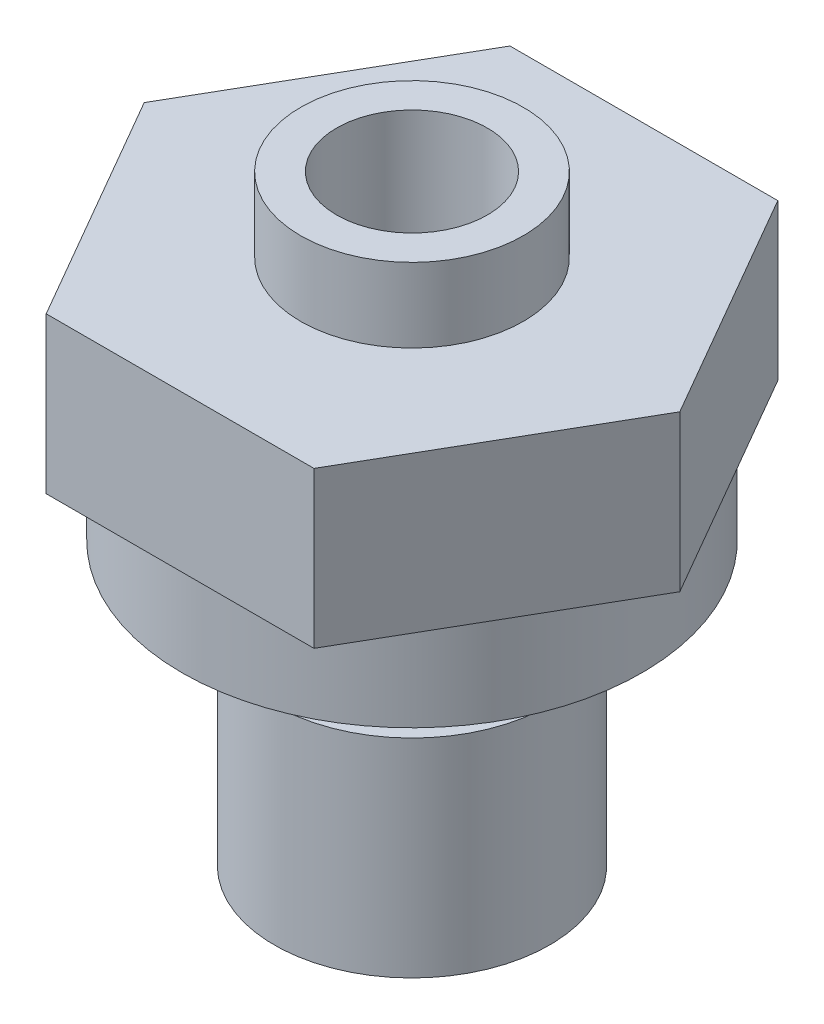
ISO-10303-21;
HEADER;
FILE_DESCRIPTION(('STEP AP214'),'2;1');
FILE_NAME('part.step','',(''),(''),'','','');
FILE_SCHEMA(('AUTOMOTIVE_DESIGN { 1 0 10303 214 1 1 1 1 }'));
ENDSEC;
DATA;
#1=APPLICATION_CONTEXT('core data for automotive mechanical design processes');
#2=APPLICATION_PROTOCOL_DEFINITION('international standard','automotive_design',2000,#1);
#3=PRODUCT_CONTEXT('',#1,'mechanical');
#4=PRODUCT('Part','Part','',(#3));
#5=PRODUCT_RELATED_PRODUCT_CATEGORY('part','',(#4));
#6=PRODUCT_DEFINITION_FORMATION('','',#4);
#7=PRODUCT_DEFINITION_CONTEXT('part definition',#1,'design');
#8=PRODUCT_DEFINITION('design','',#6,#7);
#9=PRODUCT_DEFINITION_SHAPE('','',#8);
#10=(LENGTH_UNIT() NAMED_UNIT(*) SI_UNIT(.MILLI.,.METRE.));
#11=(NAMED_UNIT(*) PLANE_ANGLE_UNIT() SI_UNIT($,.RADIAN.));
#12=(NAMED_UNIT(*) SI_UNIT($,.STERADIAN.) SOLID_ANGLE_UNIT());
#13=UNCERTAINTY_MEASURE_WITH_UNIT(LENGTH_MEASURE(1.E-05),#10,'distance_accuracy_value','');
#14=(GEOMETRIC_REPRESENTATION_CONTEXT(3) GLOBAL_UNCERTAINTY_ASSIGNED_CONTEXT((#13)) GLOBAL_UNIT_ASSIGNED_CONTEXT((#10,
#11,#12)) REPRESENTATION_CONTEXT('',''));
#15=CARTESIAN_POINT('',(0.,0.,0.));
#16=DIRECTION('',(0.,0.,1.));
#17=DIRECTION('',(1.,0.,0.));
#18=AXIS2_PLACEMENT_3D('',#15,#16,#17);
#19=CARTESIAN_POINT('',(0.,-12.7,0.));
#20=DIRECTION('',(0.,1.,0.));
#21=DIRECTION('',(0.,0.,1.));
#22=AXIS2_PLACEMENT_3D('',#19,#20,#21);
#23=CYLINDRICAL_SURFACE('',#22,1.524);
#24=CARTESIAN_POINT('',(0.,-8.63599999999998,0.));
#25=DIRECTION('',(0.,-1.,0.));
#26=DIRECTION('',(0.,0.,-1.));
#27=AXIS2_PLACEMENT_3D('',#24,#25,#26);
#28=CIRCLE('',#27,1.524);
#29=CARTESIAN_POINT('',(0.,-8.63599999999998,-1.524));
#30=VERTEX_POINT('',#29);
#31=EDGE_CURVE('E11',#30,#30,#28,.T.);
#32=ORIENTED_EDGE('',*,*,#31,.T.);
#33=EDGE_LOOP('',(#32));
#34=FACE_BOUND('',#33,.T.);
#35=CARTESIAN_POINT('',(0.,3.556,0.));
#36=DIRECTION('',(0.,1.,0.));
#37=DIRECTION('',(0.,0.,1.));
#38=AXIS2_PLACEMENT_3D('',#35,#36,#37);
#39=CIRCLE('',#38,1.524);
#40=CARTESIAN_POINT('',(0.,3.556,1.524));
#41=VERTEX_POINT('',#40);
#42=EDGE_CURVE('E119',#41,#41,#39,.T.);
#43=ORIENTED_EDGE('',*,*,#42,.T.);
#44=EDGE_LOOP('',(#43));
#45=FACE_BOUND('',#44,.T.);
#46=ADVANCED_FACE('F30',(#34,#45),#23,.F.);
#47=CARTESIAN_POINT('',(9.16543552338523,5.334,0.));
#48=DIRECTION('',(0.,1.,0.));
#49=DIRECTION('',(0.,0.,1.));
#50=AXIS2_PLACEMENT_3D('',#47,#48,#49);
#51=PLANE('',#50);
#52=DIRECTION('',(-0.499999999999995,0.,-0.866025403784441));
#53=VECTOR('',#52,1.);
#54=CARTESIAN_POINT('',(6.87407664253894,5.334,-3.96874999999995));
#55=LINE('',#54,#53);
#56=CARTESIAN_POINT('',(9.16543552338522,5.334,0.));
#57=VERTEX_POINT('',#56);
#58=CARTESIAN_POINT('',(4.5827177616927,5.334,-7.93749999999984));
#59=VERTEX_POINT('',#58);
#60=EDGE_CURVE('E103',#57,#59,#55,.T.);
#61=ORIENTED_EDGE('',*,*,#60,.T.);
#62=DIRECTION('',(-1.,0.,0.));
#63=VECTOR('',#62,1.);
#64=CARTESIAN_POINT('',(0.,5.334,-7.9375));
#65=LINE('',#64,#63);
#66=CARTESIAN_POINT('',(-4.5827177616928,5.334,-7.93749999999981));
#67=VERTEX_POINT('',#66);
#68=EDGE_CURVE('E106',#59,#67,#65,.T.);
#69=ORIENTED_EDGE('',*,*,#68,.T.);
#70=DIRECTION('',(-0.499999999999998,0.,0.86602540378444));
#71=VECTOR('',#70,1.);
#72=CARTESIAN_POINT('',(-6.87407664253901,5.334,-3.96874999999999));
#73=LINE('',#72,#71);
#74=CARTESIAN_POINT('',(-9.16543552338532,5.334,0.));
#75=VERTEX_POINT('',#74);
#76=EDGE_CURVE('E236',#67,#75,#73,.T.);
#77=ORIENTED_EDGE('',*,*,#76,.T.);
#78=DIRECTION('',(0.499999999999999,0.,0.866025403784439));
#79=VECTOR('',#78,1.);
#80=CARTESIAN_POINT('',(-6.87407664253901,5.334,3.96874999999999));
#81=LINE('',#80,#79);
#82=CARTESIAN_POINT('',(-4.58271776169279,5.334,7.9374999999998));
#83=VERTEX_POINT('',#82);
#84=EDGE_CURVE('E225',#75,#83,#81,.T.);
#85=ORIENTED_EDGE('',*,*,#84,.T.);
#86=DIRECTION('',(1.,0.,0.));
#87=VECTOR('',#86,1.);
#88=CARTESIAN_POINT('',(0.,5.334,7.9375));
#89=LINE('',#88,#87);
#90=CARTESIAN_POINT('',(4.5827177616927,5.334,7.93749999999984));
#91=VERTEX_POINT('',#90);
#92=EDGE_CURVE('E50',#83,#91,#89,.T.);
#93=ORIENTED_EDGE('',*,*,#92,.T.);
#94=DIRECTION('',(0.499999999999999,0.,-0.866025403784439));
#95=VECTOR('',#94,1.);
#96=CARTESIAN_POINT('',(6.87407664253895,5.334,3.96874999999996));
#97=LINE('',#96,#95);
#98=EDGE_CURVE('E45',#91,#57,#97,.T.);
#99=ORIENTED_EDGE('',*,*,#98,.T.);
#100=EDGE_LOOP('',(#61,#69,#77,#85,#93,#99));
#101=FACE_BOUND('',#100,.T.);
#102=CARTESIAN_POINT('',(0.,5.334,0.));
#103=DIRECTION('',(0.,1.,0.));
#104=DIRECTION('',(0.,0.,1.));
#105=AXIS2_PLACEMENT_3D('',#102,#103,#104);
#106=CIRCLE('',#105,3.81);
#107=CARTESIAN_POINT('',(0.,5.334,3.81));
#108=VERTEX_POINT('',#107);
#109=EDGE_CURVE('E274',#108,#108,#106,.T.);
#110=ORIENTED_EDGE('',*,*,#109,.F.);
#111=EDGE_LOOP('',(#110));
#112=FACE_BOUND('',#111,.T.);
#113=ADVANCED_FACE('F140',(#101,#112),#51,.T.);
#114=CARTESIAN_POINT('',(0.,-3.048,0.));
#115=DIRECTION('',(0.,-1.,0.));
#116=DIRECTION('',(0.,0.,-1.));
#117=AXIS2_PLACEMENT_3D('',#114,#115,#116);
#118=PLANE('',#117);
#119=CARTESIAN_POINT('',(0.,-3.048,0.));
#120=DIRECTION('',(0.,-1.,0.));
#121=DIRECTION('',(0.,0.,-1.));
#122=AXIS2_PLACEMENT_3D('',#119,#120,#121);
#123=CIRCLE('',#122,4.826);
#124=CARTESIAN_POINT('',(0.,-3.048,-4.826));
#125=VERTEX_POINT('',#124);
#126=EDGE_CURVE('E256',#125,#125,#123,.T.);
#127=ORIENTED_EDGE('',*,*,#126,.T.);
#128=EDGE_LOOP('',(#127));
#129=FACE_BOUND('',#128,.T.);
#130=CARTESIAN_POINT('',(0.,-3.048,0.));
#131=DIRECTION('',(0.,-1.,0.));
#132=DIRECTION('',(0.,0.,-1.));
#133=AXIS2_PLACEMENT_3D('',#130,#131,#132);
#134=CIRCLE('',#133,3.9751);
#135=CARTESIAN_POINT('',(0.,-3.048,-3.9751));
#136=VERTEX_POINT('',#135);
#137=EDGE_CURVE('E262',#136,#136,#134,.T.);
#138=ORIENTED_EDGE('',*,*,#137,.F.);
#139=EDGE_LOOP('',(#138));
#140=FACE_BOUND('',#139,.T.);
#141=ADVANCED_FACE('F146',(#129,#140),#118,.T.);
#142=CARTESIAN_POINT('',(9.16543552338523,0.,0.));
#143=DIRECTION('',(0.,1.,0.));
#144=DIRECTION('',(0.,0.,1.));
#145=AXIS2_PLACEMENT_3D('',#142,#143,#144);
#146=PLANE('',#145);
#147=DIRECTION('',(-1.,0.,0.));
#148=VECTOR('',#147,1.);
#149=CARTESIAN_POINT('',(0.,0.,-7.9375));
#150=LINE('',#149,#148);
#151=CARTESIAN_POINT('',(4.5827177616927,0.,-7.93749999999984));
#152=VERTEX_POINT('',#151);
#153=CARTESIAN_POINT('',(-4.5827177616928,0.,-7.93749999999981));
#154=VERTEX_POINT('',#153);
#155=EDGE_CURVE('E83',#152,#154,#150,.T.);
#156=ORIENTED_EDGE('',*,*,#155,.F.);
#157=DIRECTION('',(-0.499999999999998,0.,-0.86602540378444));
#158=VECTOR('',#157,1.);
#159=CARTESIAN_POINT('',(6.87407664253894,0.,-3.96874999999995));
#160=LINE('',#159,#158);
#161=CARTESIAN_POINT('',(9.16543552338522,0.,0.));
#162=VERTEX_POINT('',#161);
#163=EDGE_CURVE('E87',#162,#152,#160,.T.);
#164=ORIENTED_EDGE('',*,*,#163,.F.);
#165=DIRECTION('',(0.499999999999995,0.,-0.866025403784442));
#166=VECTOR('',#165,1.);
#167=CARTESIAN_POINT('',(6.87407664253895,0.,3.96874999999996));
#168=LINE('',#167,#166);
#169=CARTESIAN_POINT('',(4.5827177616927,0.,7.93749999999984));
#170=VERTEX_POINT('',#169);
#171=EDGE_CURVE('E104',#170,#162,#168,.T.);
#172=ORIENTED_EDGE('',*,*,#171,.F.);
#173=DIRECTION('',(1.,0.,0.));
#174=VECTOR('',#173,1.);
#175=CARTESIAN_POINT('',(0.,0.,7.9375));
#176=LINE('',#175,#174);
#177=CARTESIAN_POINT('',(-4.58271776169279,0.,7.9374999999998));
#178=VERTEX_POINT('',#177);
#179=EDGE_CURVE('E241',#178,#170,#176,.T.);
#180=ORIENTED_EDGE('',*,*,#179,.F.);
#181=DIRECTION('',(0.500000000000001,0.,0.866025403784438));
#182=VECTOR('',#181,1.);
#183=CARTESIAN_POINT('',(-6.87407664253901,0.,3.96874999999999));
#184=LINE('',#183,#182);
#185=CARTESIAN_POINT('',(-9.16543552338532,0.,0.));
#186=VERTEX_POINT('',#185);
#187=EDGE_CURVE('E220',#186,#178,#184,.T.);
#188=ORIENTED_EDGE('',*,*,#187,.F.);
#189=DIRECTION('',(-0.499999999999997,0.,0.86602540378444));
#190=VECTOR('',#189,1.);
#191=CARTESIAN_POINT('',(-6.87407664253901,0.,-3.96874999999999));
#192=LINE('',#191,#190);
#193=EDGE_CURVE('E89',#154,#186,#192,.T.);
#194=ORIENTED_EDGE('',*,*,#193,.F.);
#195=EDGE_LOOP('',(#156,#164,#172,#180,#188,#194));
#196=FACE_BOUND('',#195,.T.);
#197=CARTESIAN_POINT('',(0.,0.,0.));
#198=DIRECTION('',(0.,1.,0.));
#199=DIRECTION('',(0.,0.,1.));
#200=AXIS2_PLACEMENT_3D('',#197,#198,#199);
#201=CIRCLE('',#200,7.874);
#202=CARTESIAN_POINT('',(0.,0.,7.874));
#203=VERTEX_POINT('',#202);
#204=EDGE_CURVE('E107',#203,#203,#201,.F.);
#205=ORIENTED_EDGE('',*,*,#204,.F.);
#206=EDGE_LOOP('',(#205));
#207=FACE_BOUND('',#206,.T.);
#208=ADVANCED_FACE('F85',(#196,#207),#146,.F.);
#209=CARTESIAN_POINT('',(0.,5.334,-7.9375));
#210=DIRECTION('',(0.,0.,1.));
#211=DIRECTION('',(1.,0.,0.));
#212=AXIS2_PLACEMENT_3D('',#209,#210,#211);
#213=PLANE('',#212);
#214=ORIENTED_EDGE('',*,*,#155,.T.);
#215=DIRECTION('',(0.,-1.,0.));
#216=VECTOR('',#215,1.);
#217=CARTESIAN_POINT('',(-4.5827177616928,5.334,-7.93749999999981));
#218=LINE('',#217,#216);
#219=EDGE_CURVE('E108',#67,#154,#218,.T.);
#220=ORIENTED_EDGE('',*,*,#219,.F.);
#221=ORIENTED_EDGE('',*,*,#68,.F.);
#222=DIRECTION('',(0.,-1.,0.));
#223=VECTOR('',#222,1.);
#224=CARTESIAN_POINT('',(4.5827177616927,5.334,-7.93749999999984));
#225=LINE('',#224,#223);
#226=EDGE_CURVE('E100',#59,#152,#225,.T.);
#227=ORIENTED_EDGE('',*,*,#226,.T.);
#228=EDGE_LOOP('',(#214,#220,#221,#227));
#229=FACE_BOUND('',#228,.T.);
#230=ADVANCED_FACE('F32',(#229),#213,.F.);
#231=CARTESIAN_POINT('',(-6.87407664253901,5.334,-3.96874999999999));
#232=DIRECTION('',(0.866025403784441,0.,0.499999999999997));
#233=DIRECTION('',(0.499999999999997,0.,-0.866025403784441));
#234=AXIS2_PLACEMENT_3D('',#231,#232,#233);
#235=PLANE('',#234);
#236=ORIENTED_EDGE('',*,*,#193,.T.);
#237=DIRECTION('',(0.,-1.,0.));
#238=VECTOR('',#237,1.);
#239=CARTESIAN_POINT('',(-9.16543552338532,5.334,0.));
#240=LINE('',#239,#238);
#241=EDGE_CURVE('E113',#75,#186,#240,.T.);
#242=ORIENTED_EDGE('',*,*,#241,.F.);
#243=ORIENTED_EDGE('',*,*,#76,.F.);
#244=ORIENTED_EDGE('',*,*,#219,.T.);
#245=EDGE_LOOP('',(#236,#242,#243,#244));
#246=FACE_BOUND('',#245,.T.);
#247=ADVANCED_FACE('F209',(#246),#235,.F.);
#248=CARTESIAN_POINT('',(-6.87407664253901,5.334,3.96874999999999));
#249=DIRECTION('',(0.866025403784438,0.,-0.500000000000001));
#250=DIRECTION('',(-0.500000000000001,0.,-0.866025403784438));
#251=AXIS2_PLACEMENT_3D('',#248,#249,#250);
#252=PLANE('',#251);
#253=ORIENTED_EDGE('',*,*,#187,.T.);
#254=DIRECTION('',(0.,-1.,0.));
#255=VECTOR('',#254,1.);
#256=CARTESIAN_POINT('',(-4.58271776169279,5.334,7.9374999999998));
#257=LINE('',#256,#255);
#258=EDGE_CURVE('E226',#83,#178,#257,.T.);
#259=ORIENTED_EDGE('',*,*,#258,.F.);
#260=ORIENTED_EDGE('',*,*,#84,.F.);
#261=ORIENTED_EDGE('',*,*,#241,.T.);
#262=EDGE_LOOP('',(#253,#259,#260,#261));
#263=FACE_BOUND('',#262,.T.);
#264=ADVANCED_FACE('F206',(#263),#252,.F.);
#265=CARTESIAN_POINT('',(0.,5.334,7.9375));
#266=DIRECTION('',(0.,0.,-1.));
#267=DIRECTION('',(-1.,0.,0.));
#268=AXIS2_PLACEMENT_3D('',#265,#266,#267);
#269=PLANE('',#268);
#270=ORIENTED_EDGE('',*,*,#179,.T.);
#271=DIRECTION('',(0.,-1.,0.));
#272=VECTOR('',#271,1.);
#273=CARTESIAN_POINT('',(4.5827177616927,5.334,7.93749999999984));
#274=LINE('',#273,#272);
#275=EDGE_CURVE('E227',#91,#170,#274,.T.);
#276=ORIENTED_EDGE('',*,*,#275,.F.);
#277=ORIENTED_EDGE('',*,*,#92,.F.);
#278=ORIENTED_EDGE('',*,*,#258,.T.);
#279=EDGE_LOOP('',(#270,#276,#277,#278));
#280=FACE_BOUND('',#279,.T.);
#281=ADVANCED_FACE('F202',(#280),#269,.F.);
#282=CARTESIAN_POINT('',(6.87407664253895,5.334,3.96874999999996));
#283=DIRECTION('',(-0.866025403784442,0.,-0.499999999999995));
#284=DIRECTION('',(-0.499999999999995,0.,0.866025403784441));
#285=AXIS2_PLACEMENT_3D('',#282,#283,#284);
#286=PLANE('',#285);
#287=ORIENTED_EDGE('',*,*,#171,.T.);
#288=DIRECTION('',(0.,-1.,0.));
#289=VECTOR('',#288,1.);
#290=CARTESIAN_POINT('',(9.16543552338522,5.334,0.));
#291=LINE('',#290,#289);
#292=EDGE_CURVE('E102',#57,#162,#291,.T.);
#293=ORIENTED_EDGE('',*,*,#292,.F.);
#294=ORIENTED_EDGE('',*,*,#98,.F.);
#295=ORIENTED_EDGE('',*,*,#275,.T.);
#296=EDGE_LOOP('',(#287,#293,#294,#295));
#297=FACE_BOUND('',#296,.T.);
#298=ADVANCED_FACE('F199',(#297),#286,.F.);
#299=CARTESIAN_POINT('',(6.87407664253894,5.334,-3.96874999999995));
#300=DIRECTION('',(-0.86602540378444,0.,0.499999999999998));
#301=DIRECTION('',(0.499999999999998,0.,0.86602540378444));
#302=AXIS2_PLACEMENT_3D('',#299,#300,#301);
#303=PLANE('',#302);
#304=ORIENTED_EDGE('',*,*,#163,.T.);
#305=ORIENTED_EDGE('',*,*,#226,.F.);
#306=ORIENTED_EDGE('',*,*,#60,.F.);
#307=ORIENTED_EDGE('',*,*,#292,.T.);
#308=EDGE_LOOP('',(#304,#305,#306,#307));
#309=FACE_BOUND('',#308,.T.);
#310=ADVANCED_FACE('F99',(#309),#303,.F.);
#311=CARTESIAN_POINT('',(0.,-3.048,0.));
#312=DIRECTION('',(0.,1.,0.));
#313=DIRECTION('',(0.,0.,1.));
#314=AXIS2_PLACEMENT_3D('',#311,#312,#313);
#315=CYLINDRICAL_SURFACE('',#314,7.874);
#316=CARTESIAN_POINT('',(0.,-3.048,0.));
#317=DIRECTION('',(0.,-1.,0.));
#318=DIRECTION('',(0.,0.,-1.));
#319=AXIS2_PLACEMENT_3D('',#316,#317,#318);
#320=CIRCLE('',#319,7.874);
#321=CARTESIAN_POINT('',(0.,-3.048,7.874));
#322=VERTEX_POINT('',#321);
#323=EDGE_CURVE('E94',#322,#322,#320,.T.);
#324=CARTESIAN_POINT('',(0.,-3.048,7.874));
#325=CARTESIAN_POINT('',(0.,-3.01625,7.874));
#326=CARTESIAN_POINT('',(0.,-2.9845,7.874));
#327=CARTESIAN_POINT('',(0.,-2.921,7.874));
#328=CARTESIAN_POINT('',(0.,-2.88925,7.874));
#329=CARTESIAN_POINT('',(0.,-2.82575,7.874));
#330=CARTESIAN_POINT('',(0.,-2.794,7.874));
#331=CARTESIAN_POINT('',(0.,-2.7305,7.874));
#332=CARTESIAN_POINT('',(0.,-2.69875,7.874));
#333=CARTESIAN_POINT('',(0.,-2.63525,7.874));
#334=CARTESIAN_POINT('',(0.,-2.6035,7.874));
#335=CARTESIAN_POINT('',(0.,-2.54,7.874));
#336=CARTESIAN_POINT('',(0.,-2.50825,7.874));
#337=CARTESIAN_POINT('',(0.,-2.44475,7.874));
#338=CARTESIAN_POINT('',(0.,-2.413,7.874));
#339=CARTESIAN_POINT('',(0.,-2.3495,7.874));
#340=CARTESIAN_POINT('',(0.,-2.31775,7.874));
#341=CARTESIAN_POINT('',(0.,-2.25425,7.874));
#342=CARTESIAN_POINT('',(0.,-2.2225,7.874));
#343=CARTESIAN_POINT('',(0.,-2.159,7.874));
#344=CARTESIAN_POINT('',(0.,-2.12725,7.874));
#345=CARTESIAN_POINT('',(0.,-2.06375,7.874));
#346=CARTESIAN_POINT('',(0.,-2.032,7.874));
#347=CARTESIAN_POINT('',(0.,-1.9685,7.874));
#348=CARTESIAN_POINT('',(0.,-1.93675,7.874));
#349=CARTESIAN_POINT('',(0.,-1.87325,7.874));
#350=CARTESIAN_POINT('',(0.,-1.8415,7.874));
#351=CARTESIAN_POINT('',(0.,-1.778,7.874));
#352=CARTESIAN_POINT('',(0.,-1.74625,7.874));
#353=CARTESIAN_POINT('',(0.,-1.68275,7.874));
#354=CARTESIAN_POINT('',(0.,-1.651,7.874));
#355=CARTESIAN_POINT('',(0.,-1.5875,7.874));
#356=CARTESIAN_POINT('',(0.,-1.55575,7.874));
#357=CARTESIAN_POINT('',(0.,-1.49225,7.874));
#358=CARTESIAN_POINT('',(0.,-1.4605,7.874));
#359=CARTESIAN_POINT('',(0.,-1.397,7.874));
#360=CARTESIAN_POINT('',(0.,-1.36525,7.874));
#361=CARTESIAN_POINT('',(0.,-1.30175,7.874));
#362=CARTESIAN_POINT('',(0.,-1.27,7.874));
#363=CARTESIAN_POINT('',(0.,-1.2065,7.874));
#364=CARTESIAN_POINT('',(0.,-1.17475,7.874));
#365=CARTESIAN_POINT('',(0.,-1.11125,7.874));
#366=CARTESIAN_POINT('',(0.,-1.0795,7.874));
#367=CARTESIAN_POINT('',(0.,-1.016,7.874));
#368=CARTESIAN_POINT('',(0.,-0.98425,7.874));
#369=CARTESIAN_POINT('',(0.,-0.92075,7.874));
#370=CARTESIAN_POINT('',(0.,-0.889,7.874));
#371=CARTESIAN_POINT('',(0.,-0.8255,7.874));
#372=CARTESIAN_POINT('',(0.,-0.79375,7.874));
#373=CARTESIAN_POINT('',(0.,-0.73025,7.874));
#374=CARTESIAN_POINT('',(0.,-0.6985,7.874));
#375=CARTESIAN_POINT('',(0.,-0.635,7.874));
#376=CARTESIAN_POINT('',(0.,-0.60325,7.874));
#377=CARTESIAN_POINT('',(0.,-0.53975,7.874));
#378=CARTESIAN_POINT('',(0.,-0.508,7.874));
#379=CARTESIAN_POINT('',(0.,-0.4445,7.874));
#380=CARTESIAN_POINT('',(0.,-0.41275,7.874));
#381=CARTESIAN_POINT('',(0.,-0.34925,7.874));
#382=CARTESIAN_POINT('',(0.,-0.3175,7.874));
#383=CARTESIAN_POINT('',(0.,-0.254,7.874));
#384=CARTESIAN_POINT('',(0.,-0.22225,7.874));
#385=CARTESIAN_POINT('',(0.,-0.15875,7.874));
#386=CARTESIAN_POINT('',(0.,-0.127,7.874));
#387=CARTESIAN_POINT('',(0.,-0.0634999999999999,7.874));
#388=CARTESIAN_POINT('',(0.,-0.03175,7.874));
#389=CARTESIAN_POINT('',(0.,0.,7.874));
#390=B_SPLINE_CURVE_WITH_KNOTS('',3,(#324,#325,#326,#327,#328,#329,#330,#331,#332,#333,#334,
#335,#336,#337,#338,#339,#340,#341,#342,#343,#344,#345,#346,#347,#348,#349,#350,#351,#352,#353,
#354,#355,#356,#357,#358,#359,#360,#361,#362,#363,#364,#365,#366,#367,#368,#369,#370,#371,#372,
#373,#374,#375,#376,#377,#378,#379,#380,#381,#382,#383,#384,#385,#386,#387,#388,#389),
.UNSPECIFIED.,.F.,.F.,(4,2,2,2,2,2,2,2,2,2,2,2,2,2,2,2,2,2,2,2,2,2,2,2,2,2,2,2,2,2,2,2,4),(0.,
0.0952499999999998,0.1905,0.28575,0.381,0.47625,0.5715,0.66675,0.762,0.85725,0.9525,1.04775,
1.143,1.23825,1.3335,1.42875,1.524,1.61925,1.7145,1.80975,1.905,2.00025,2.0955,2.19075,2.286,
2.38125,2.4765,2.57175,2.667,2.76225,2.8575,2.95275,3.048),.UNSPECIFIED.);
#391=EDGE_CURVE('BSEAM190',#322,#203,#390,.T.);
#392=ORIENTED_EDGE('',*,*,#323,.F.);
#393=ORIENTED_EDGE('',*,*,#204,.T.);
#394=ORIENTED_EDGE('',*,*,#391,.T.);
#395=ORIENTED_EDGE('',*,*,#391,.F.);
#396=EDGE_LOOP('',(#392,#394,#393,#395));
#397=FACE_BOUND('',#396,.T.);
#398=ADVANCED_FACE('F190',(#397),#315,.T.);
#399=CARTESIAN_POINT('',(0.,-3.048,0.));
#400=DIRECTION('',(0.,-1.,0.));
#401=DIRECTION('',(0.,0.,-1.));
#402=AXIS2_PLACEMENT_3D('',#399,#400,#401);
#403=CIRCLE('',#402,6.985);
#404=CARTESIAN_POINT('',(0.,-3.048,-6.985));
#405=VERTEX_POINT('',#404);
#406=EDGE_CURVE('E250',#405,#405,#403,.T.);
#407=ORIENTED_EDGE('',*,*,#406,.F.);
#408=EDGE_LOOP('',(#407));
#409=FACE_BOUND('',#408,.T.);
#410=ORIENTED_EDGE('',*,*,#323,.T.);
#411=EDGE_LOOP('',(#410));
#412=FACE_BOUND('',#411,.T.);
#413=ADVANCED_FACE('F186',(#409,#412),#118,.T.);
#414=CARTESIAN_POINT('',(0.,-1.778,0.));
#415=DIRECTION('',(0.,-1.,0.));
#416=DIRECTION('',(0.,0.,-1.));
#417=AXIS2_PLACEMENT_3D('',#414,#415,#416);
#418=CYLINDRICAL_SURFACE('',#417,6.985);
#419=CARTESIAN_POINT('',(0.,-1.778,0.));
#420=DIRECTION('',(0.,-1.,0.));
#421=DIRECTION('',(0.,0.,-1.));
#422=AXIS2_PLACEMENT_3D('',#419,#420,#421);
#423=CIRCLE('',#422,6.985);
#424=CARTESIAN_POINT('',(0.,-1.778,-6.985));
#425=VERTEX_POINT('',#424);
#426=EDGE_CURVE('E247',#425,#425,#423,.T.);
#427=ORIENTED_EDGE('',*,*,#426,.F.);
#428=EDGE_LOOP('',(#427));
#429=FACE_BOUND('',#428,.T.);
#430=ORIENTED_EDGE('',*,*,#406,.T.);
#431=EDGE_LOOP('',(#430));
#432=FACE_BOUND('',#431,.T.);
#433=ADVANCED_FACE('F182',(#429,#432),#418,.F.);
#434=CARTESIAN_POINT('',(0.,-1.778,0.));
#435=DIRECTION('',(0.,-1.,0.));
#436=DIRECTION('',(0.,0.,-1.));
#437=AXIS2_PLACEMENT_3D('',#434,#435,#436);
#438=PLANE('',#437);
#439=CARTESIAN_POINT('',(0.,-1.778,0.));
#440=DIRECTION('',(0.,-1.,0.));
#441=DIRECTION('',(0.,0.,-1.));
#442=AXIS2_PLACEMENT_3D('',#439,#440,#441);
#443=CIRCLE('',#442,4.826);
#444=CARTESIAN_POINT('',(0.,-1.778,-4.826));
#445=VERTEX_POINT('',#444);
#446=EDGE_CURVE('E253',#445,#445,#443,.T.);
#447=ORIENTED_EDGE('',*,*,#446,.F.);
#448=EDGE_LOOP('',(#447));
#449=FACE_BOUND('',#448,.T.);
#450=ORIENTED_EDGE('',*,*,#426,.T.);
#451=EDGE_LOOP('',(#450));
#452=FACE_BOUND('',#451,.T.);
#453=ADVANCED_FACE('F178',(#449,#452),#438,.T.);
#454=CARTESIAN_POINT('',(0.,-1.778,0.));
#455=DIRECTION('',(0.,-1.,0.));
#456=DIRECTION('',(0.,0.,-1.));
#457=AXIS2_PLACEMENT_3D('',#454,#455,#456);
#458=CYLINDRICAL_SURFACE('',#457,4.826);
#459=ORIENTED_EDGE('',*,*,#446,.T.);
#460=EDGE_LOOP('',(#459));
#461=FACE_BOUND('',#460,.T.);
#462=ORIENTED_EDGE('',*,*,#126,.F.);
#463=EDGE_LOOP('',(#462));
#464=FACE_BOUND('',#463,.T.);
#465=ADVANCED_FACE('F174',(#461,#464),#458,.T.);
#466=CARTESIAN_POINT('',(0.,-5.588,0.));
#467=DIRECTION('',(0.,1.,0.));
#468=DIRECTION('',(0.,0.,1.));
#469=AXIS2_PLACEMENT_3D('',#466,#467,#468);
#470=CYLINDRICAL_SURFACE('',#469,3.9751);
#471=CARTESIAN_POINT('',(0.,-5.588,0.));
#472=DIRECTION('',(0.,-1.,0.));
#473=DIRECTION('',(0.,0.,-1.));
#474=AXIS2_PLACEMENT_3D('',#471,#472,#473);
#475=CIRCLE('',#474,3.9751);
#476=CARTESIAN_POINT('',(0.,-5.588,-3.9751));
#477=VERTEX_POINT('',#476);
#478=EDGE_CURVE('E259',#477,#477,#475,.T.);
#479=ORIENTED_EDGE('',*,*,#478,.F.);
#480=EDGE_LOOP('',(#479));
#481=FACE_BOUND('',#480,.T.);
#482=ORIENTED_EDGE('',*,*,#137,.T.);
#483=EDGE_LOOP('',(#482));
#484=FACE_BOUND('',#483,.T.);
#485=ADVANCED_FACE('F165',(#481,#484),#470,.T.);
#486=CARTESIAN_POINT('',(0.,-5.588,0.));
#487=DIRECTION('',(0.,-1.,0.));
#488=DIRECTION('',(0.,0.,-1.));
#489=AXIS2_PLACEMENT_3D('',#486,#487,#488);
#490=PLANE('',#489);
#491=CARTESIAN_POINT('',(0.,-5.588,0.));
#492=DIRECTION('',(0.,-1.,0.));
#493=DIRECTION('',(0.,0.,-1.));
#494=AXIS2_PLACEMENT_3D('',#491,#492,#493);
#495=CIRCLE('',#494,4.7117);
#496=CARTESIAN_POINT('',(0.,-5.588,-4.7117));
#497=VERTEX_POINT('',#496);
#498=EDGE_CURVE('E268',#497,#497,#495,.T.);
#499=ORIENTED_EDGE('',*,*,#498,.F.);
#500=EDGE_LOOP('',(#499));
#501=FACE_BOUND('',#500,.T.);
#502=ORIENTED_EDGE('',*,*,#478,.T.);
#503=EDGE_LOOP('',(#502));
#504=FACE_BOUND('',#503,.T.);
#505=ADVANCED_FACE('F161',(#501,#504),#490,.F.);
#506=CARTESIAN_POINT('',(0.,-12.7,0.));
#507=DIRECTION('',(0.,1.,0.));
#508=DIRECTION('',(0.,0.,1.));
#509=AXIS2_PLACEMENT_3D('',#506,#507,#508);
#510=CYLINDRICAL_SURFACE('',#509,4.7117);
#511=CARTESIAN_POINT('',(0.,-12.7,0.));
#512=DIRECTION('',(0.,-1.,0.));
#513=DIRECTION('',(0.,0.,-1.));
#514=AXIS2_PLACEMENT_3D('',#511,#512,#513);
#515=CIRCLE('',#514,4.7117);
#516=CARTESIAN_POINT('',(0.,-12.7,-4.7117));
#517=VERTEX_POINT('',#516);
#518=EDGE_CURVE('E265',#517,#517,#515,.T.);
#519=ORIENTED_EDGE('',*,*,#518,.F.);
#520=EDGE_LOOP('',(#519));
#521=FACE_BOUND('',#520,.T.);
#522=ORIENTED_EDGE('',*,*,#498,.T.);
#523=EDGE_LOOP('',(#522));
#524=FACE_BOUND('',#523,.T.);
#525=ADVANCED_FACE('F164',(#521,#524),#510,.T.);
#526=CARTESIAN_POINT('',(0.,-12.7,0.));
#527=DIRECTION('',(0.,-1.,0.));
#528=DIRECTION('',(0.,0.,-1.));
#529=AXIS2_PLACEMENT_3D('',#526,#527,#528);
#530=PLANE('',#529);
#531=CARTESIAN_POINT('',(0.,-12.7,0.));
#532=DIRECTION('',(0.,-1.,0.));
#533=DIRECTION('',(0.,0.,-1.));
#534=AXIS2_PLACEMENT_3D('',#531,#532,#533);
#535=CIRCLE('',#534,3.87035149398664);
#536=CARTESIAN_POINT('',(0.,-12.7,-3.87035149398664));
#537=VERTEX_POINT('',#536);
#538=EDGE_CURVE('E38',#537,#537,#535,.F.);
#539=ORIENTED_EDGE('',*,*,#538,.T.);
#540=EDGE_LOOP('',(#539));
#541=FACE_BOUND('',#540,.T.);
#542=ORIENTED_EDGE('',*,*,#518,.T.);
#543=EDGE_LOOP('',(#542));
#544=FACE_BOUND('',#543,.T.);
#545=ADVANCED_FACE('F124',(#541,#544),#530,.T.);
#546=CARTESIAN_POINT('',(0.,7.874,0.));
#547=DIRECTION('',(0.,-1.,0.));
#548=DIRECTION('',(0.,0.,-1.));
#549=AXIS2_PLACEMENT_3D('',#546,#547,#548);
#550=CYLINDRICAL_SURFACE('',#549,3.81);
#551=CARTESIAN_POINT('',(0.,7.874,0.));
#552=DIRECTION('',(0.,1.,0.));
#553=DIRECTION('',(0.,0.,1.));
#554=AXIS2_PLACEMENT_3D('',#551,#552,#553);
#555=CIRCLE('',#554,3.81);
#556=CARTESIAN_POINT('',(0.,7.874,3.81));
#557=VERTEX_POINT('',#556);
#558=EDGE_CURVE('E271',#557,#557,#555,.T.);
#559=ORIENTED_EDGE('',*,*,#558,.F.);
#560=EDGE_LOOP('',(#559));
#561=FACE_BOUND('',#560,.T.);
#562=ORIENTED_EDGE('',*,*,#109,.T.);
#563=EDGE_LOOP('',(#562));
#564=FACE_BOUND('',#563,.T.);
#565=ADVANCED_FACE('F156',(#561,#564),#550,.T.);
#566=CARTESIAN_POINT('',(0.,7.874,0.));
#567=DIRECTION('',(0.,1.,0.));
#568=DIRECTION('',(0.,0.,1.));
#569=AXIS2_PLACEMENT_3D('',#566,#567,#568);
#570=PLANE('',#569);
#571=CARTESIAN_POINT('',(0.,7.874,0.));
#572=DIRECTION('',(0.,1.,0.));
#573=DIRECTION('',(0.,0.,1.));
#574=AXIS2_PLACEMENT_3D('',#571,#572,#573);
#575=CIRCLE('',#574,2.58064);
#576=CARTESIAN_POINT('',(0.,7.874,2.58064));
#577=VERTEX_POINT('',#576);
#578=EDGE_CURVE('E280',#577,#577,#575,.T.);
#579=ORIENTED_EDGE('',*,*,#578,.F.);
#580=EDGE_LOOP('',(#579));
#581=FACE_BOUND('',#580,.T.);
#582=ORIENTED_EDGE('',*,*,#558,.T.);
#583=EDGE_LOOP('',(#582));
#584=FACE_BOUND('',#583,.T.);
#585=ADVANCED_FACE('F152',(#581,#584),#570,.T.);
#586=CARTESIAN_POINT('',(0.,4.064,0.));
#587=DIRECTION('',(0.,1.,0.));
#588=DIRECTION('',(0.,0.,1.));
#589=AXIS2_PLACEMENT_3D('',#586,#587,#588);
#590=PLANE('',#589);
#591=CARTESIAN_POINT('',(0.,4.064,0.));
#592=DIRECTION('',(0.,1.,0.));
#593=DIRECTION('',(0.,0.,1.));
#594=AXIS2_PLACEMENT_3D('',#591,#592,#593);
#595=CIRCLE('',#594,2.54);
#596=CARTESIAN_POINT('',(0.,4.064,2.54));
#597=VERTEX_POINT('',#596);
#598=EDGE_CURVE('E111',#597,#597,#595,.F.);
#599=ORIENTED_EDGE('',*,*,#598,.T.);
#600=EDGE_LOOP('',(#599));
#601=FACE_BOUND('',#600,.T.);
#602=CARTESIAN_POINT('',(0.,4.064,0.));
#603=DIRECTION('',(0.,1.,0.));
#604=DIRECTION('',(0.,0.,1.));
#605=AXIS2_PLACEMENT_3D('',#602,#603,#604);
#606=CIRCLE('',#605,2.58064);
#607=CARTESIAN_POINT('',(0.,4.064,2.58064));
#608=VERTEX_POINT('',#607);
#609=EDGE_CURVE('E277',#608,#608,#606,.T.);
#610=ORIENTED_EDGE('',*,*,#609,.T.);
#611=EDGE_LOOP('',(#610));
#612=FACE_BOUND('',#611,.T.);
#613=ADVANCED_FACE('F155',(#601,#612),#590,.T.);
#614=CARTESIAN_POINT('',(0.,4.064,0.));
#615=DIRECTION('',(0.,1.,0.));
#616=DIRECTION('',(0.,0.,1.));
#617=AXIS2_PLACEMENT_3D('',#614,#615,#616);
#618=CYLINDRICAL_SURFACE('',#617,2.58064);
#619=CARTESIAN_POINT('',(0.,4.064,2.58064));
#620=CARTESIAN_POINT('',(0.,4.1036875,2.58064));
#621=CARTESIAN_POINT('',(0.,4.143375,2.58064));
#622=CARTESIAN_POINT('',(0.,4.22275,2.58064));
#623=CARTESIAN_POINT('',(0.,4.2624375,2.58064));
#624=CARTESIAN_POINT('',(0.,4.3418125,2.58064));
#625=CARTESIAN_POINT('',(0.,4.3815,2.58064));
#626=CARTESIAN_POINT('',(0.,4.460875,2.58064));
#627=CARTESIAN_POINT('',(0.,4.5005625,2.58064));
#628=CARTESIAN_POINT('',(0.,4.5799375,2.58064));
#629=CARTESIAN_POINT('',(0.,4.619625,2.58064));
#630=CARTESIAN_POINT('',(0.,4.699,2.58064));
#631=CARTESIAN_POINT('',(0.,4.7386875,2.58064));
#632=CARTESIAN_POINT('',(0.,4.8180625,2.58064));
#633=CARTESIAN_POINT('',(0.,4.85775,2.58064));
#634=CARTESIAN_POINT('',(0.,4.937125,2.58064));
#635=CARTESIAN_POINT('',(0.,4.9768125,2.58064));
#636=CARTESIAN_POINT('',(0.,5.0561875,2.58064));
#637=CARTESIAN_POINT('',(0.,5.095875,2.58064));
#638=CARTESIAN_POINT('',(0.,5.17525,2.58064));
#639=CARTESIAN_POINT('',(0.,5.2149375,2.58064));
#640=CARTESIAN_POINT('',(0.,5.2943125,2.58064));
#641=CARTESIAN_POINT('',(0.,5.334,2.58064));
#642=CARTESIAN_POINT('',(0.,5.413375,2.58064));
#643=CARTESIAN_POINT('',(0.,5.4530625,2.58064));
#644=CARTESIAN_POINT('',(0.,5.5324375,2.58064));
#645=CARTESIAN_POINT('',(0.,5.572125,2.58064));
#646=CARTESIAN_POINT('',(0.,5.6515,2.58064));
#647=CARTESIAN_POINT('',(0.,5.6911875,2.58064));
#648=CARTESIAN_POINT('',(0.,5.7705625,2.58064));
#649=CARTESIAN_POINT('',(0.,5.81025,2.58064));
#650=CARTESIAN_POINT('',(0.,5.889625,2.58064));
#651=CARTESIAN_POINT('',(0.,5.9293125,2.58064));
#652=CARTESIAN_POINT('',(0.,6.0086875,2.58064));
#653=CARTESIAN_POINT('',(0.,6.048375,2.58064));
#654=CARTESIAN_POINT('',(0.,6.12775,2.58064));
#655=CARTESIAN_POINT('',(0.,6.1674375,2.58064));
#656=CARTESIAN_POINT('',(0.,6.2468125,2.58064));
#657=CARTESIAN_POINT('',(0.,6.2865,2.58064));
#658=CARTESIAN_POINT('',(0.,6.365875,2.58064));
#659=CARTESIAN_POINT('',(0.,6.4055625,2.58064));
#660=CARTESIAN_POINT('',(0.,6.4849375,2.58064));
#661=CARTESIAN_POINT('',(0.,6.524625,2.58064));
#662=CARTESIAN_POINT('',(0.,6.604,2.58064));
#663=CARTESIAN_POINT('',(0.,6.6436875,2.58064));
#664=CARTESIAN_POINT('',(0.,6.7230625,2.58064));
#665=CARTESIAN_POINT('',(0.,6.76275,2.58064));
#666=CARTESIAN_POINT('',(0.,6.842125,2.58064));
#667=CARTESIAN_POINT('',(0.,6.8818125,2.58064));
#668=CARTESIAN_POINT('',(0.,6.9611875,2.58064));
#669=CARTESIAN_POINT('',(0.,7.000875,2.58064));
#670=CARTESIAN_POINT('',(0.,7.08025,2.58064));
#671=CARTESIAN_POINT('',(0.,7.1199375,2.58064));
#672=CARTESIAN_POINT('',(0.,7.1993125,2.58064));
#673=CARTESIAN_POINT('',(0.,7.239,2.58064));
#674=CARTESIAN_POINT('',(0.,7.318375,2.58064));
#675=CARTESIAN_POINT('',(0.,7.3580625,2.58064));
#676=CARTESIAN_POINT('',(0.,7.4374375,2.58064));
#677=CARTESIAN_POINT('',(0.,7.477125,2.58064));
#678=CARTESIAN_POINT('',(0.,7.5565,2.58064));
#679=CARTESIAN_POINT('',(0.,7.5961875,2.58064));
#680=CARTESIAN_POINT('',(0.,7.6755625,2.58064));
#681=CARTESIAN_POINT('',(0.,7.71525,2.58064));
#682=CARTESIAN_POINT('',(0.,7.794625,2.58064));
#683=CARTESIAN_POINT('',(0.,7.8343125,2.58064));
#684=CARTESIAN_POINT('',(0.,7.874,2.58064));
#685=B_SPLINE_CURVE_WITH_KNOTS('',3,(#619,#620,#621,#622,#623,#624,#625,#626,#627,#628,#629,
#630,#631,#632,#633,#634,#635,#636,#637,#638,#639,#640,#641,#642,#643,#644,#645,#646,#647,#648,
#649,#650,#651,#652,#653,#654,#655,#656,#657,#658,#659,#660,#661,#662,#663,#664,#665,#666,#667,
#668,#669,#670,#671,#672,#673,#674,#675,#676,#677,#678,#679,#680,#681,#682,#683,#684),
.UNSPECIFIED.,.F.,.F.,(4,2,2,2,2,2,2,2,2,2,2,2,2,2,2,2,2,2,2,2,2,2,2,2,2,2,2,2,2,2,2,2,4),(0.,
0.1190625,0.238125,0.3571875,0.47625,0.5953125,0.714375,0.8334375,0.9525,1.0715625,1.190625,
1.3096875,1.42875,1.5478125,1.666875,1.7859375,1.905,2.0240625,2.143125,2.2621875,2.38125,
2.5003125,2.619375,2.7384375,2.8575,2.9765625,3.095625,3.2146875,3.33375,3.4528125,3.571875,
3.6909375,3.81),.UNSPECIFIED.);
#686=EDGE_CURVE('BSEAM135',#608,#577,#685,.T.);
#687=ORIENTED_EDGE('',*,*,#609,.F.);
#688=ORIENTED_EDGE('',*,*,#578,.T.);
#689=ORIENTED_EDGE('',*,*,#686,.T.);
#690=ORIENTED_EDGE('',*,*,#686,.F.);
#691=EDGE_LOOP('',(#687,#689,#688,#690));
#692=FACE_BOUND('',#691,.T.);
#693=ADVANCED_FACE('F135',(#692),#618,.F.);
#694=CARTESIAN_POINT('',(0.,4.064,0.));
#695=DIRECTION('',(0.,1.,0.));
#696=DIRECTION('',(0.,0.,1.));
#697=AXIS2_PLACEMENT_3D('',#694,#695,#696);
#698=CONICAL_SURFACE('',#697,2.54,1.10714871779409);
#699=ORIENTED_EDGE('',*,*,#42,.F.);
#700=EDGE_LOOP('',(#699));
#701=FACE_BOUND('',#700,.T.);
#702=ORIENTED_EDGE('',*,*,#598,.F.);
#703=EDGE_LOOP('',(#702));
#704=FACE_BOUND('',#703,.T.);
#705=ADVANCED_FACE('F129',(#701,#704),#698,.F.);
#706=CARTESIAN_POINT('',(0.,-12.7,0.));
#707=DIRECTION('',(0.,-1.,0.));
#708=DIRECTION('',(0.,0.,-1.));
#709=AXIS2_PLACEMENT_3D('',#706,#707,#708);
#710=CONICAL_SURFACE('',#709,3.87035149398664,0.523598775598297);
#711=ORIENTED_EDGE('',*,*,#31,.F.);
#712=EDGE_LOOP('',(#711));
#713=FACE_BOUND('',#712,.T.);
#714=ORIENTED_EDGE('',*,*,#538,.F.);
#715=EDGE_LOOP('',(#714));
#716=FACE_BOUND('',#715,.T.);
#717=ADVANCED_FACE('F127',(#713,#716),#710,.F.);
#718=CLOSED_SHELL('',(#46,#113,#141,#208,#230,#247,#264,#281,#298,#310,#398,#413,#433,#453,#465,
#485,#505,#525,#545,#565,#585,#613,#693,#705,#717));
#719=MANIFOLD_SOLID_BREP('B2',#718);
#720=ADVANCED_BREP_SHAPE_REPRESENTATION('',(#18,#719),#14);
#721=SHAPE_DEFINITION_REPRESENTATION(#9,#720);
ENDSEC;
END-ISO-10303-21;
